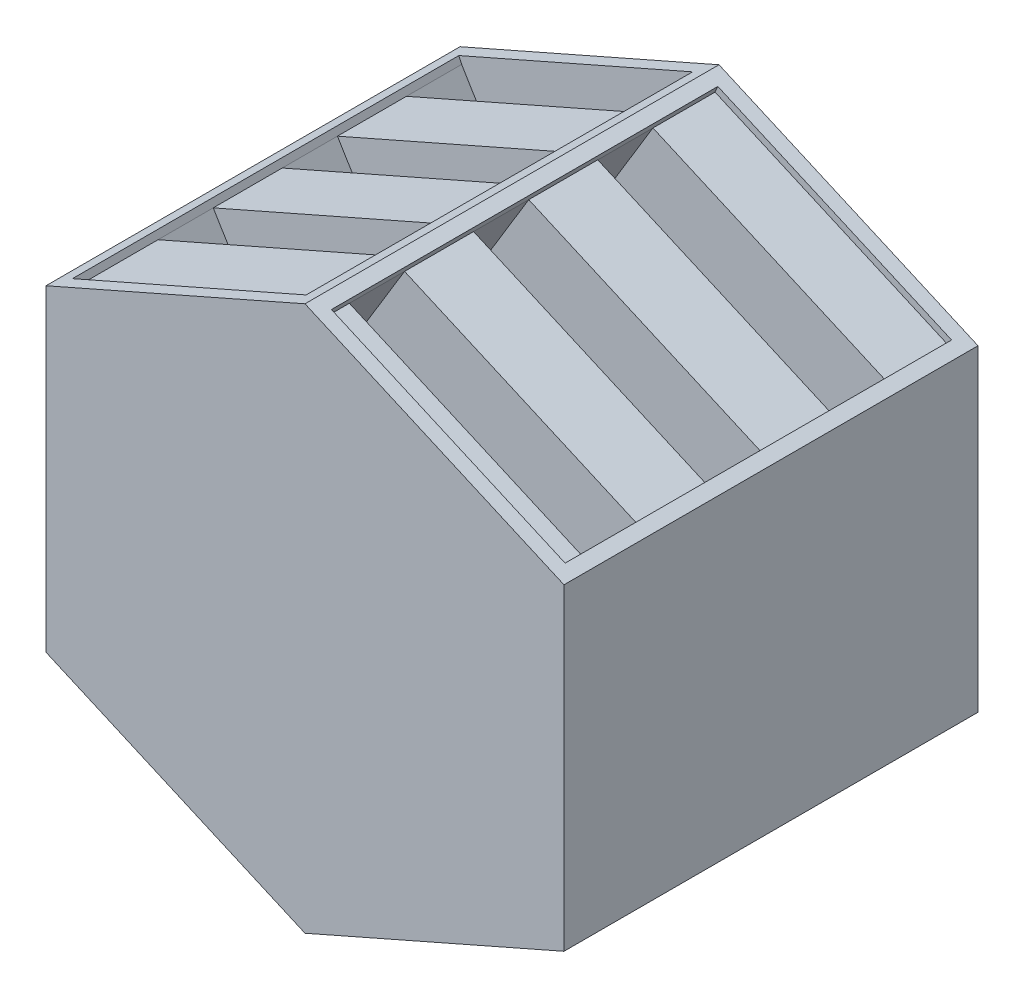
from build123d import *

# Parameters (mm, degrees)
EXTRUSION1_DEPTH           = 150
ESQUISSE2_W                = 185
ESQUISSE2_H                = 280
ENL_V_MAT_EXTRU_1_DEPTH    = 5
ESQUISSE3_W                = 185
ESQUISSE3_H                = 280
ENL_V_MAT_EXTRU_2_DEPTH    = 5
ESQUISSE4_W                = 185
ESQUISSE4_H                = 280
ENL_V_MAT_EXTRU_3_DEPTH    = 8
ESQUISSE5_W                = 185
ESQUISSE5_H                = 280
ENL_V_MAT_EXTRU_4_DEPTH    = 8
ENL_V_MAT_EXTRU_5_DEPTH    = 40
ENL_V_MAT_EXTRU_6_DEPTH    = 40
R_P_TITION_LIN_AIRE1_COUNT = 3
R_P_TITION_LIN_AIRE1_PITCH = 90


with BuildPart() as part:
    # Esquisse1 → Extrusion1 (new, symmetric)
    with BuildSketch(Plane.XY):
        Polygon((-187.666592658, -263.94473817), (-187.666592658, -33.94473817), (0, 48.55526183), (187.666592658, -33.94473817), (187.666592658, -263.94473817), (0, -346.44473817), align=None)
    extrude(amount=EXTRUSION1_DEPTH, both=True)

    # Esquisse2 → Enl_v. mat.-Extru.1 (cut)
    with BuildSketch(Plane(origin=(17.888317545, 40.691389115, 0), x_dir=(-0.9154467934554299, 0.40243902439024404, 0), z_dir=(0.40243902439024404, 0.9154467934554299, 0))):
        with Locations((-82.9594678, 0)):
            Rectangle(ESQUISSE2_W, ESQUISSE2_H)
    extrude(amount=-ENL_V_MAT_EXTRU_1_DEPTH, mode=Mode.SUBTRACT)

    # Esquisse3 → Enl_v. mat.-Extru.2 (cut)
    with BuildSketch(Plane(origin=(-17.888317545, 40.691389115, 0), x_dir=(-0.9154467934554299, -0.402439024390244, 0), z_dir=(-0.402439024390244, 0.9154467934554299, 0))):
        with Locations((82.9594678, 0)):
            Rectangle(ESQUISSE3_W, ESQUISSE3_H)
    extrude(amount=-ENL_V_MAT_EXTRU_2_DEPTH, mode=Mode.SUBTRACT)

    # Esquisse4 → Enl_v. mat.-Extru.3 (cut)
    with BuildSketch(Plane(origin=(-127.634230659, -290.335529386, 0), x_dir=(0.9154467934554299, -0.40243902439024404, 0), z_dir=(-0.40243902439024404, -0.9154467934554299, 0))):
        with Locations((36.922882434, 0)):
            Rectangle(ESQUISSE4_W, ESQUISSE4_H)
    extrude(amount=-ENL_V_MAT_EXTRU_3_DEPTH, mode=Mode.SUBTRACT)

    # Esquisse5 → Enl_v. mat.-Extru.4 (cut)
    with BuildSketch(Plane(origin=(127.634230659, -290.335529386, 0), x_dir=(0.91544679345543, 0.4024390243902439, 0), z_dir=(0.4024390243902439, -0.91544679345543, 0))):
        with Locations((-36.922882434, 0)):
            Rectangle(ESQUISSE5_W, ESQUISSE5_H)
    extrude(amount=-ENL_V_MAT_EXTRU_4_DEPTH, mode=Mode.SUBTRACT)

    # Esquisse6 → Enl_v. mat.-Extru.5 (cut)
    with BuildSketch(Plane.XY.offset(-140)):
        Polygon((-7.142272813, 39.953637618), (175.292612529, -260.645554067), (5.934955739, -335.096773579), (-176.499929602, -34.497581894), align=None)
    enl_v_mat_extru_5 = extrude(amount=ENL_V_MAT_EXTRU_5_DEPTH, mode=Mode.SUBTRACT)

    # Esquisse7 → Enl_v. mat.-Extru.6 (cut)
    with BuildSketch(Plane.XY.offset(-95)):
        Polygon((176.499929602, -34.497581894), (-5.934955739, -335.096773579), (-175.292612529, -260.645554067), (7.142272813, 39.953637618), align=None)
    enl_v_mat_extru_6 = extrude(amount=ENL_V_MAT_EXTRU_6_DEPTH, mode=Mode.SUBTRACT)

    # R_p_tition lin_aire1: Enl_v. mat.-Extru.5, Enl_v. mat.-Extru.6 ×3
    with Locations(*[(0, 0, i * R_P_TITION_LIN_AIRE1_PITCH) for i in range(1, R_P_TITION_LIN_AIRE1_COUNT)]):
        add(enl_v_mat_extru_5, mode=Mode.SUBTRACT)
        add(enl_v_mat_extru_6, mode=Mode.SUBTRACT)


solid = part.part
